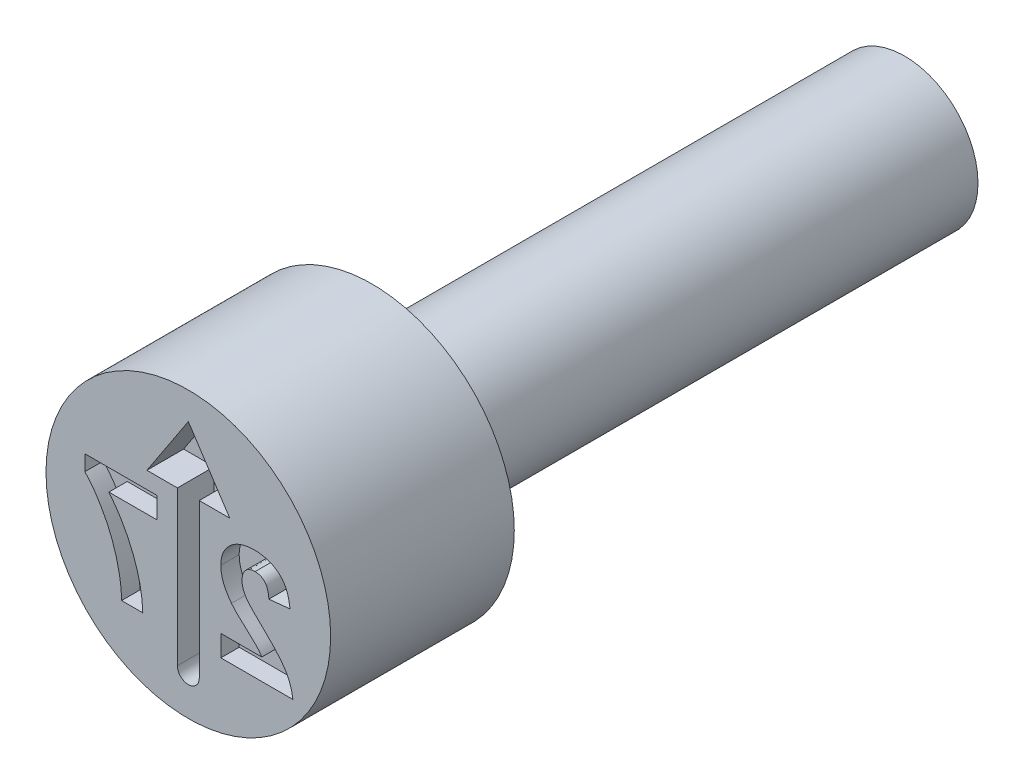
from build123d import *

# Parameters (mm, degrees)
CUT_EXTRUDE4_DEPTH = 0.4
CUT_EXTRUDE5_DEPTH = 0.2


with BuildPart() as part:
    # Sketch2 → Revolve1 (revolve)
    with BuildSketch(Plane(origin=(0, 0, 0), x_dir=(0, 0, -1), z_dir=(1, 0, 0)), mode=Mode.PRIVATE) as revolve1_sk:
        Polygon((0, 1.55), (0, 0), (7.8, 0), (7.8, 0.8), (2, 0.8), (2, 1.55), align=None)
    revolve(revolve1_sk.sketch.rotate(Axis((0, 0, -0.403888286), (0, 0, -1)), 90), axis=Axis((0, 0, -0.403888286), (0, 0, -1)))

    # Sketch3 → Cut-Extrude4 (cut)
    with BuildSketch(Plane.XY):
        with BuildLine():
            Line((0.119045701, 0.566469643), (0.119045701, -1.110101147))
            ThreePointArc((0.119045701, -1.110101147), (0, -1.229146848), (-0.119045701, -1.110101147))
            Line((-0.119045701, -1.110101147), (-0.119045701, 0.566469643))
            Line((-0.119045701, 0.566469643), (-0.451198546, 0.566469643))
            Line((-0.451198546, 0.566469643), (0, 1.251322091))
            Line((0, 1.251322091), (0.451198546, 0.566469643))
            Line((0.451198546, 0.566469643), (0.119045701, 0.566469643))
        make_face()
    extrude(amount=-CUT_EXTRUDE4_DEPTH, mode=Mode.SUBTRACT)

    # Sketch4 → Cut-Extrude5 (cut)
    with BuildSketch(Plane.XY):
        with BuildLine():
            Line((0.353846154, -0.569230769), (0.353846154, -0.8))
            Line((0.353846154, -0.8), (1.138461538, -0.8))
            add(Edge.make_bspline(
                [(1.138461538, -0.8), (1.135805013, -0.780277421), (1.13049345, -0.740843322), (1.114071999, -0.683240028), (1.092154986, -0.627029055), (1.068368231, -0.581286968), (1.044709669, -0.544466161), (1.023244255, -0.514294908), (0.997636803, -0.482193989), (0.968258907, -0.447904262), (0.935272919, -0.411318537), (0.898432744, -0.372572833), (0.857562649, -0.331852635), (0.828809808, -0.304201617), (0.813942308, -0.289903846)],
                knots=[0, 0, 0, 0, 1.156289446, 2.311930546, 3.473459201, 4.661751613, 5.303057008, 6.018253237, 6.81459331, 7.690699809, 8.644447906, 9.679642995, 10.800191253, 12, 12, 12, 12], degree=3))
            add(Edge.make_bspline(
                [(0.813942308, -0.289903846), (0.802077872, -0.278451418), (0.779491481, -0.256649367), (0.747328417, -0.225429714), (0.719053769, -0.196729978), (0.694076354, -0.171293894), (0.672973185, -0.148473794), (0.65546667, -0.128628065), (0.641335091, -0.111675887), (0.633681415, -0.100921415), (0.630288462, -0.096153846)],
                knots=[0, 0, 0, 0, 1.480720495, 2.818855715, 4.024636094, 5.098235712, 6.019786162, 6.815086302, 7.474715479, 8, 8, 8, 8], degree=3))
            add(Edge.make_bspline(
                [(0.630288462, -0.096153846), (0.623340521, -0.084612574), (0.609938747, -0.062350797), (0.595242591, -0.02734375), (0.58642141, 0.007656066), (0.585210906, 0.031042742), (0.584615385, 0.042548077)],
                knots=[0, 0, 0, 0, 1.0911822, 2.104764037, 3.067617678, 4, 4, 4, 4], degree=3))
            add(Edge.make_bspline(
                [(0.584615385, 0.042548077), (0.585047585, 0.054520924), (0.585865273, 0.077172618), (0.592721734, 0.109138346), (0.604880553, 0.136617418), (0.621621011, 0.159694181), (0.642789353, 0.177774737), (0.66753576, 0.191134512), (0.69622248, 0.198520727), (0.716385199, 0.199492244), (0.726923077, 0.2)],
                knots=[0, 0, 0, 0, 1.193122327, 2.257294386, 3.237245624, 4.168877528, 5.075331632, 5.990371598, 6.949684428, 8, 8, 8, 8], degree=3))
            add(Edge.make_bspline(
                [(0.726923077, 0.2), (0.737389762, 0.199525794), (0.757609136, 0.198609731), (0.786345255, 0.190607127), (0.811484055, 0.176753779), (0.829399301, 0.160966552), (0.8415019, 0.14561462), (0.849748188, 0.132236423), (0.856855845, 0.117034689), (0.863153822, 0.100180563), (0.868128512, 0.081480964), (0.872134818, 0.061078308), (0.875363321, 0.0388628), (0.876390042, 0.023408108), (0.876923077, 0.015384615)],
                knots=[0, 0, 0, 0, 1.402788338, 2.709884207, 3.961032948, 5.225417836, 5.883680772, 6.578928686, 7.329201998, 8.132101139, 8.990263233, 9.922304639, 10.921339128, 12, 12, 12, 12], degree=3))
            Line((0.876923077, 0.015384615), (1.107692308, 0.037980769))
            add(Edge.make_bspline(
                [(1.107692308, 0.037980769), (1.105836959, 0.053560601), (1.102239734, 0.083767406), (1.093262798, 0.127154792), (1.081893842, 0.167181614), (1.067590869, 0.20377359), (1.050945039, 0.237163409), (1.031107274, 0.266850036), (1.008770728, 0.293162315), (0.983916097, 0.316086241), (0.95670139, 0.335694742), (0.928144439, 0.353198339), (0.897687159, 0.367556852), (0.865664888, 0.379390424), (0.832092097, 0.38884772), (0.796813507, 0.395100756), (0.760046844, 0.399499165), (0.734949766, 0.399830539), (0.722115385, 0.4)],
                knots=[0, 0, 0, 0, 1.270971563, 2.464210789, 3.586263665, 4.638946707, 5.643716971, 6.603612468, 7.52484387, 8.434700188, 9.336036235, 10.239171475, 11.145359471, 12.059630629, 13.003312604, 13.96741569, 14.960557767, 16, 16, 16, 16], degree=3))
            add(Edge.make_bspline(
                [(0.722115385, 0.4), (0.708162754, 0.399731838), (0.680988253, 0.399209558), (0.641318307, 0.394896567), (0.604051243, 0.387376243), (0.568861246, 0.37741451), (0.536109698, 0.364114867), (0.505523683, 0.348036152), (0.47758457, 0.328568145), (0.451875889, 0.30677252), (0.428894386, 0.282804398), (0.408764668, 0.257238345), (0.391900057, 0.230092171), (0.377748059, 0.201696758), (0.367240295, 0.171595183), (0.359583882, 0.140203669), (0.354507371, 0.107375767), (0.354068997, 0.084955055), (0.353846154, 0.073557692)],
                knots=[0, 0, 0, 0, 1.210756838, 2.35810096, 3.457354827, 4.507168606, 5.527358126, 6.519769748, 7.499700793, 8.476517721, 9.440526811, 10.376769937, 11.295256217, 12.209626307, 13.124630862, 14.055668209, 15.011616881, 16, 16, 16, 16], degree=3))
            add(Edge.make_bspline(
                [(0.353846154, 0.073557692), (0.354139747, 0.060477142), (0.354722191, 0.034527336), (0.36029866, -0.003834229), (0.368818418, -0.041311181), (0.38140995, -0.07799511), (0.397370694, -0.114765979), (0.417944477, -0.151706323), (0.441832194, -0.189930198), (0.460535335, -0.214643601), (0.470192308, -0.227403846)],
                knots=[0, 0, 0, 0, 0.953409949, 1.89141903, 2.821310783, 3.752688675, 4.715703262, 5.740811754, 6.833515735, 8, 8, 8, 8], degree=3))
            add(Edge.make_bspline(
                [(0.470192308, -0.227403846), (0.473842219, -0.232000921), (0.481659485, -0.241846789), (0.494958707, -0.256943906), (0.510371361, -0.273434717), (0.527679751, -0.291627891), (0.547455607, -0.310879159), (0.568987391, -0.331993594), (0.593222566, -0.353891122), (0.618324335, -0.377117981), (0.643535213, -0.399724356), (0.666707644, -0.4211954), (0.687755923, -0.440192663), (0.70569979, -0.45776488), (0.7215947, -0.472712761), (0.734867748, -0.485802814), (0.745767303, -0.496718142), (0.760786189, -0.513732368), (0.779896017, -0.536744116), (0.793340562, -0.558732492), (0.799759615, -0.569230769)],
                knots=[0, 0, 0, 0, 0.665555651, 1.425465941, 2.280616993, 3.225313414, 4.272635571, 5.410053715, 6.644756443, 7.976022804, 9.288331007, 10.484517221, 11.558462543, 12.503158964, 13.33222979, 14.032602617, 14.617328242, 15.080653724, 16.606167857, 18, 18, 18, 18], degree=3))
            Line((0.799759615, -0.569230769), (0.353846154, -0.569230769))
        make_face()
        with BuildLine():
            Line((-0.342153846, 0.153846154), (-0.342153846, 0.384615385))
            Line((-0.342153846, 0.384615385), (-1.126769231, 0.384615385))
            Line((-1.126769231, 0.384615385), (-1.126769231, 0.215384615))
            add(Edge.make_bspline(
                [(-1.126769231, 0.215384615), (-1.118584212, 0.207056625), (-1.101758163, 0.18993667), (-1.077656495, 0.161918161), (-1.053197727, 0.131513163), (-1.028893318, 0.098311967), (-1.003987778, 0.062839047), (-0.979575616, 0.024414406), (-0.954816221, -0.016463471), (-0.921482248, -0.07428531), (-0.882518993, -0.149818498), (-0.84129793, -0.243710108), (-0.806179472, -0.340485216), (-0.782131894, -0.422944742), (-0.765883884, -0.489035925), (-0.75526822, -0.537363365), (-0.746332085, -0.584330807), (-0.739062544, -0.630020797), (-0.733637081, -0.674454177), (-0.72935004, -0.717476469), (-0.727234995, -0.759192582), (-0.726922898, -0.786536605), (-0.726769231, -0.8)],
                knots=[0, 0, 0, 0, 0.628545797, 1.29210959, 1.98878689, 2.729126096, 3.507039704, 4.322017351, 5.179550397, 6.080149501, 7.915136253, 9.752312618, 11.597470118, 13.454141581, 14.373891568, 15.261584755, 16.117868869, 16.947726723, 17.752002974, 18.527724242, 19.275094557, 20, 20, 20, 20], degree=3))
            Line((-0.726769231, -0.8), (-0.496, -0.8))
            add(Edge.make_bspline(
                [(-0.496, -0.8), (-0.49677164, -0.779556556), (-0.498323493, -0.738442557), (-0.504129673, -0.676731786), (-0.513248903, -0.61479123), (-0.524575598, -0.552477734), (-0.53952966, -0.489942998), (-0.556596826, -0.426955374), (-0.577271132, -0.363851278), (-0.600446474, -0.300751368), (-0.626030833, -0.238254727), (-0.653914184, -0.177136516), (-0.684024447, -0.117778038), (-0.715970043, -0.059970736), (-0.750122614, -0.003900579), (-0.786507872, 0.050371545), (-0.824609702, 0.103238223), (-0.851852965, 0.136979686), (-0.865471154, 0.153846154)],
                knots=[0, 0, 0, 0, 0.943249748, 1.896978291, 2.856365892, 3.829648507, 4.816416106, 5.820376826, 6.838120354, 7.877341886, 8.919613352, 9.951365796, 10.974227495, 11.988073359, 12.996274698, 14.000568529, 15.000536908, 16, 16, 16, 16], degree=3))
            Line((-0.865471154, 0.153846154), (-0.342153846, 0.153846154))
        make_face()
    extrude(amount=-CUT_EXTRUDE5_DEPTH, mode=Mode.SUBTRACT)


solid = part.part
